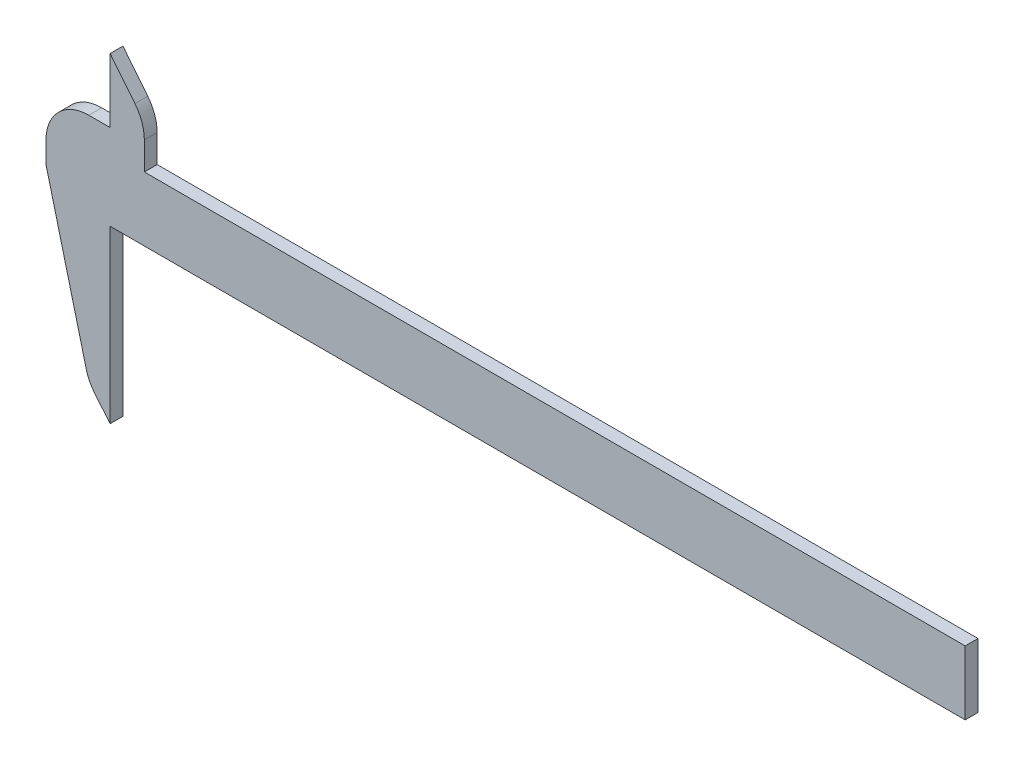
from build123d import *

# Parameters (mm, degrees)
BOSS_EXTRU_1_DEPTH = 3
CONG_1_R           = 10
CONG_2_R           = 10
CONG_3_R           = 10


with BuildPart() as part:
    # Esquisse1 → Boss.-Extru.1 (new body)
    with BuildSketch(Plane.XY):
        Polygon((0, 0), (200, 0), (200, 15), (8, 15), (8, 25), (0, 35), (0, 20), (-15, 20), (-15, 5), (-5, -34), (0, -40), align=None)
    extrude(amount=BOSS_EXTRU_1_DEPTH)

    # Cong_1
    cong_1_edges = [part.edges().sort_by_distance(p)[0] for p in [
        (-15, 20, 1.5),
    ]]
    fillet(cong_1_edges, radius=CONG_1_R)

    # Cong_2
    cong_2_edges = [part.edges().sort_by_distance(p)[0] for p in [
        (-5, -34, 1.5),
    ]]
    fillet(cong_2_edges, radius=CONG_2_R)

    # Cong_3
    cong_3_edges = [part.edges().sort_by_distance(p)[0] for p in [
        (8, 25, 1.5),
    ]]
    fillet(cong_3_edges, radius=CONG_3_R)


solid = part.part
